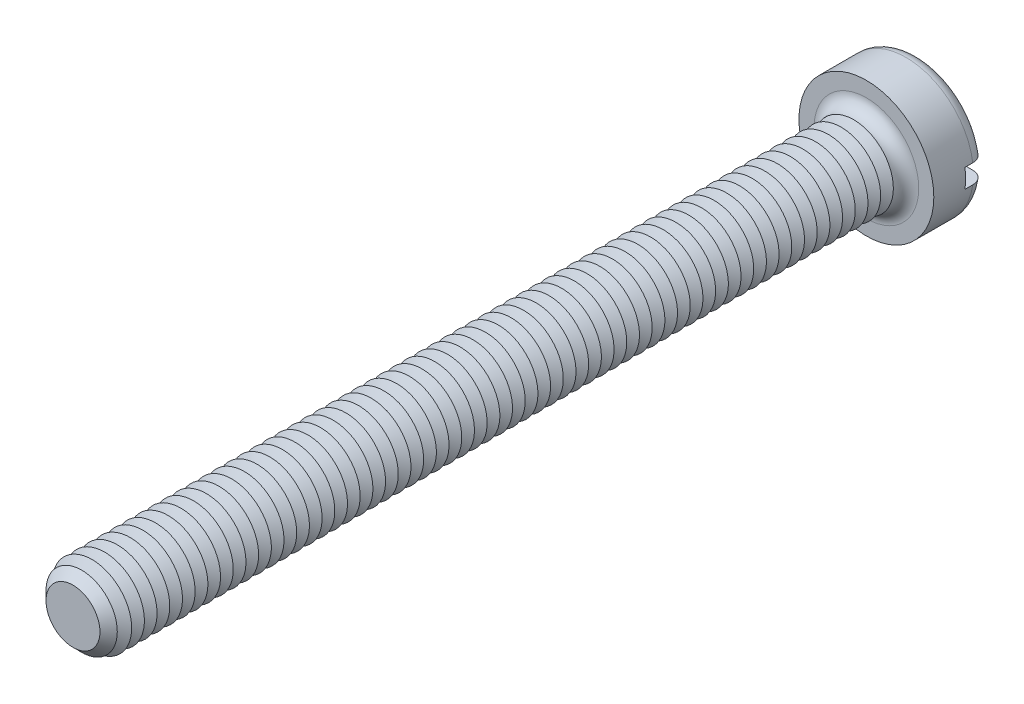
from build123d import *

# Parameters (mm, degrees)
SKETCH3_R           = 4.25
BOSS_EXTRUDE2_DEPTH = 3.3
SKETCH4_R           = 2.5
BOSS_EXTRUDE3_DEPTH = 50
FILLET1_R           = 0.8
CHAMFER1_SIZE       = 0.8
LPATTERN1_COUNT     = 61
LPATTERN1_PITCH     = 0.8
SKETCH8_W           = 8.5
SKETCH8_H           = 1.2
CUT_EXTRUDE1_DEPTH  = 1.3


with BuildPart() as part:
    # Sketch3 → Boss-Extrude2 (new body)
    with BuildSketch(Plane.XY):
        Circle(SKETCH3_R)
    extrude(amount=-BOSS_EXTRUDE2_DEPTH)

    # Sketch4 → Boss-Extrude3 (add)
    with BuildSketch(Plane.XY):
        Circle(SKETCH4_R)
    extrude(amount=BOSS_EXTRUDE3_DEPTH)

    # Fillet1
    fillet1_edges = [part.edges().sort_by_distance(p)[0] for p in [
        (-4.25, 0, -3.3),
        (-2.5, 0, 0),
    ]]
    fillet(fillet1_edges, radius=FILLET1_R)

    # Chamfer1
    chamfer1_edges = [part.edges().sort_by_distance(p)[0] for p in [
        (-2.5, 0, 50),
    ]]
    chamfer(chamfer1_edges, length=CHAMFER1_SIZE)

    # Sketch6 → Cut-Revolve1 (revolve, cut)
    with BuildSketch(Plane(origin=(0, 0, 0), x_dir=(0, 0, -1), z_dir=(1, 0, 0)), mode=Mode.PRIVATE) as cut_revolve1_sk:
        Polygon((-0.8, 2.5), (-1.2, 1.807179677), (-1.6, 2.5), align=None)
    cut_revolve1 = revolve(cut_revolve1_sk.sketch.rotate(Axis((0, 0, -1.694361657), (0, 0, 1)), 90), axis=Axis((0, 0, -1.694361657), (0, 0, 1)), mode=Mode.SUBTRACT)

    # LPattern1: Cut-Revolve1 ×61
    with Locations(*[(0, 0, i * LPATTERN1_PITCH) for i in range(1, LPATTERN1_COUNT)]):
        add(cut_revolve1, mode=Mode.SUBTRACT)

    # Sketch8 → Cut-Extrude1 (cut)
    with BuildSketch(Plane(origin=(0, 0, -3.3), x_dir=(-1, 0, 0), z_dir=(0, 0, -1))):
        Rectangle(SKETCH8_W, SKETCH8_H)
    extrude(amount=-CUT_EXTRUDE1_DEPTH, mode=Mode.SUBTRACT)


solid = part.part
